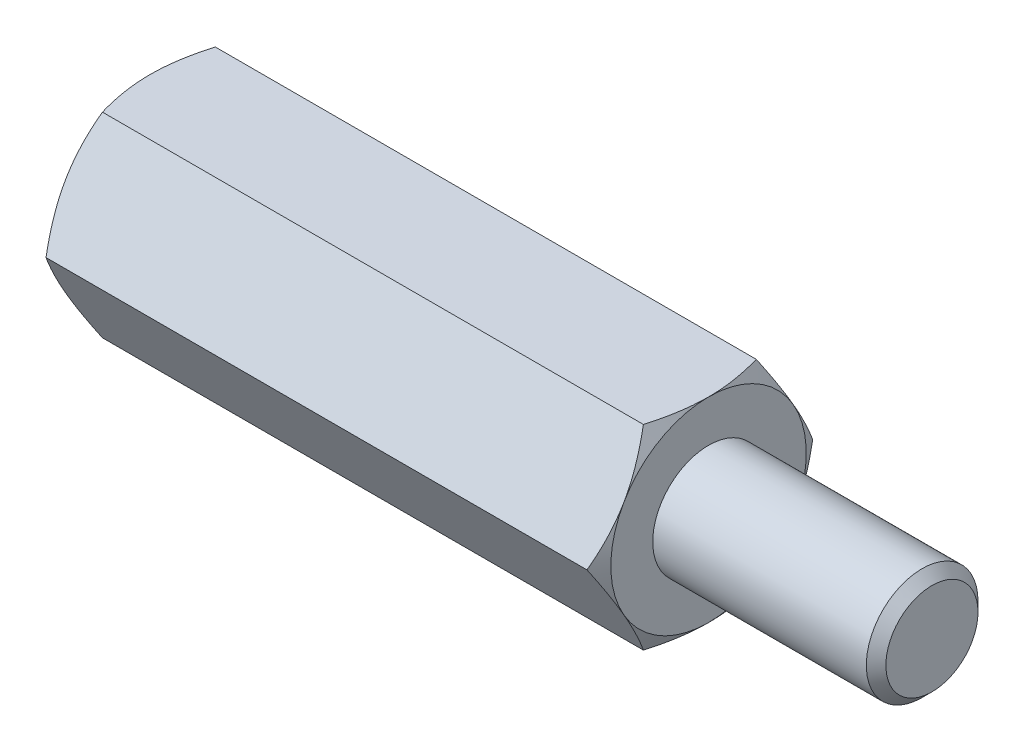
from build123d import *

# Parameters (mm, degrees)
EXTRUDE2_DEPTH = 10
SKETCH3_R      = 1.65
EXTRUDE3_DEPTH = 8
SKETCH5_R      = 2
EXTRUDE4_DEPTH = 8
CHAMFER1_SIZE  = 0.35


with BuildPart() as part:
    # Sketch1 → Extrude2 (new, symmetric)
    with BuildSketch(Plane(origin=(0, 0, 0), x_dir=(0, 0, -1), z_dir=(1, 0, 0))):
        Polygon((2.020725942, 3.5), (-2.020725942, 3.5), (-4.041451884, 0), (-2.020725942, -3.5), (2.020725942, -3.5), (4.041451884, 0), align=None)
    extrude(amount=EXTRUDE2_DEPTH, both=True)

    # Sketch2 → Cut-Revolve1 (revolve, cut)
    with BuildSketch(Plane.XY):
        with BuildLine():
            Line((-10, 3.5), (-8.5, 6.098076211))
            ThreePointArc((-8.5, 6.098076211), (-8.98810136, 7.276457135), (-10, 6.5))
            Line((-10, 6.5), (-10, 3.5))
        make_face()
    cut_revolve1 = revolve(axis=Axis((0, 0, 0), (1, 0, 0)), mode=Mode.SUBTRACT)

    # Mirror1: Cut-Revolve1 across plane
    add(cut_revolve1.mirror(Plane(origin=(0, 0, 0), x_dir=(0, 0, 1), z_dir=(1, 0, 0))), mode=Mode.SUBTRACT)

    # Sketch3 → Extrude3 (cut)
    with BuildSketch(Plane.ZY.offset(10)):
        Circle(SKETCH3_R)
    extrude(amount=-EXTRUDE3_DEPTH, mode=Mode.SUBTRACT)

    # Sketch4 → Cut-Revolve2 (revolve, cut)
    with BuildSketch(Plane.XY, mode=Mode.PRIVATE) as cut_revolve2_sk:
        Polygon((-2, 0), (-2, 1.65), (-1.047372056, 0), align=None)
    revolve(cut_revolve2_sk.sketch.rotate(Axis((-1.047372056, 0, 0), (-1, 0, 0)), 270), axis=Axis((-1.047372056, 0, 0), (-1, 0, 0)), mode=Mode.SUBTRACT)

    # Sketch5 → Extrude4 (add)
    with BuildSketch(Plane(origin=(10, 0, 0), x_dir=(0, 0, -1), z_dir=(1, 0, 0))):
        Circle(SKETCH5_R)
    extrude(amount=EXTRUDE4_DEPTH)

    # Chamfer1
    chamfer1_edges = [part.edges().sort_by_distance(p)[0] for p in [
        (18, 0, 2),
    ]]
    chamfer(chamfer1_edges, length=CHAMFER1_SIZE)


solid = part.part
